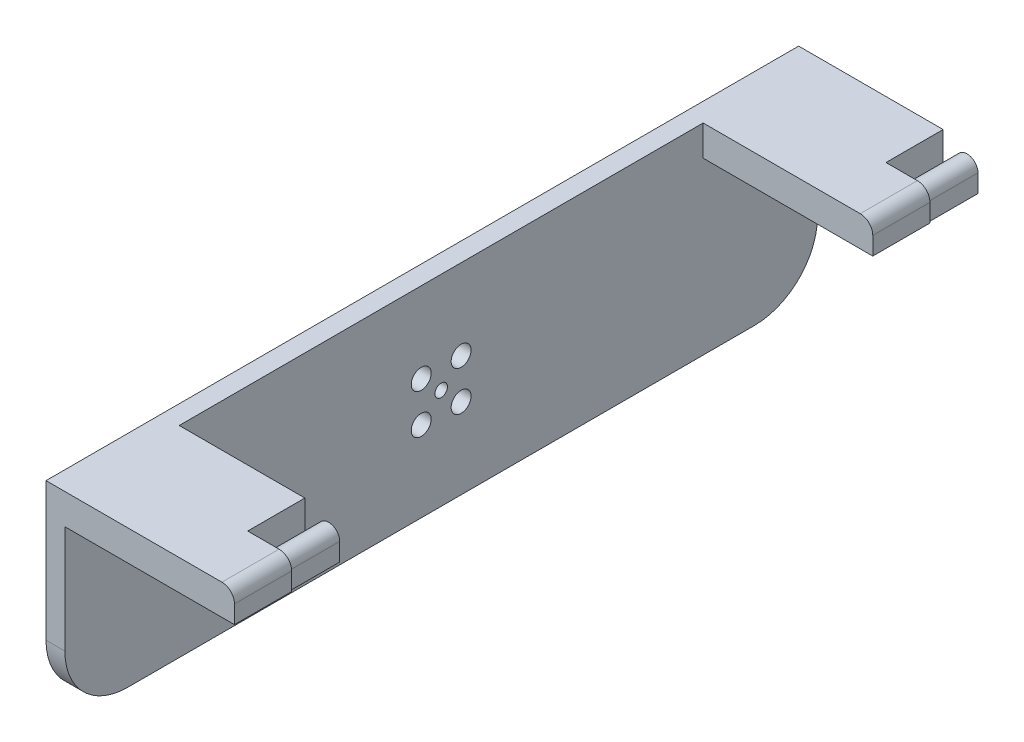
from build123d import *

# Parameters (mm, degrees)
EXTRUDE1_DEPTH           = 7.9
SKETCH2_R                = 0.59563
CUT_EXTRUDE1_DEPTH       = 3.5
EXTRUDE2_DEPTH           = 9.1
SKETCH4_W                = 20
SKETCH4_H                = 4.85
EXTRUDE3_DEPTH           = 9.1
SKETCH5_W                = 119.8
SKETCH5_H                = 32
SKETCH5_R                = 1
WIDE_BASE_DEPTH          = 3
LPATTERN1_COUNT          = 2
LPATTERN1_PITCH          = 101.6
EXTRUDE5_START           = 7.9
EXTRUDE5_DEPTH           = 7.9
SKETCH7_R                = 0.59563
CUT_EXTRUDE2_DEPTH       = 3
FILLET1_R                = 10
SKETCH10_R               = 1.5875
F_2SMALL_TOP_HOLES_DEPTH = 111.439304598


with BuildPart() as part:
    # Sketch1 → Extrude1 (new body)
    with BuildSketch(Plane.XY):
        with BuildLine():
            Line((-1.75, 0), (-1.75, -2.85))
            Line((-1.75, -2.85), (1.75, -2.85))
            Line((1.75, -2.85), (1.75, 0))
            ThreePointArc((1.75, 0), (0, 1.75), (-1.75, 0))
        make_face()
    extrude(amount=EXTRUDE1_DEPTH)

    # Sketch2 → Cut-Extrude1 (cut)
    with BuildSketch(Plane.XZ.offset(2.85)):
        with Locations(Location((0, 6.4, 0), (0, 0, 270))):
            Circle(SKETCH2_R)
    extrude(amount=-CUT_EXTRUDE1_DEPTH, mode=Mode.SUBTRACT)

    # Sketch3 → Extrude2 (add)
    with BuildSketch(Plane.XY.offset(7.9)):
        with BuildLine():
            Line((2, -2.85), (-25, -2.85))
            Line((-25, -2.85), (-25, 2))
            Line((-25, 2), (0, 2))
            ThreePointArc((0, 2), (1.414213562, 1.414213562), (2, 0))
            Line((2, 0), (2, -2.85))
        make_face()
    extrude2 = extrude(amount=EXTRUDE2_DEPTH)

    # Sketch4 → Extrude3 (add)
    with BuildSketch(Plane(origin=(0, 0, 7.9), x_dir=(-1, 0, 0), z_dir=(0, 0, -1))):
        with Locations((15, -0.425)):
            Rectangle(SKETCH4_W, SKETCH4_H)
    extrude3 = extrude(amount=EXTRUDE3_DEPTH)

    # Sketch5 → WIDE_BASE (add)
    with BuildSketch(Plane.ZY.offset(25)):
        with Locations((-42.9, -14)):
            Rectangle(SKETCH5_W, SKETCH5_H)
        with Locations((-42.9, -14)):
            Circle(SKETCH5_R, mode=Mode.SUBTRACT)
    extrude(amount=WIDE_BASE_DEPTH)

    # LPattern1: Extrude2, Extrude3 ×2
    with Locations(*[(0, 0, -i * LPATTERN1_PITCH) for i in range(1, LPATTERN1_COUNT)]):
        add(extrude2)
        add(extrude3)

    # Sketch6 → Extrude5 (add)
    with BuildSketch(Plane(origin=(0, 0, -93.7), x_dir=(-1, 0, 0), z_dir=(0, 0, -1)).offset(EXTRUDE5_START)):
        with BuildLine():
            Line((-1.75, -2.85), (1.75, -2.85))
            Line((1.75, -2.85), (1.75, 0))
            ThreePointArc((1.75, 0), (0, 1.75), (-1.75, 0))
            Line((-1.75, 0), (-1.75, -2.85))
        make_face()
    extrude(amount=-EXTRUDE5_DEPTH)

    # Sketch7 → Cut-Extrude2 (cut)
    with BuildSketch(Plane.XZ.offset(2.85)):
        with Locations(Location((0, -95.2, 0), (0, 0, 270))):
            Circle(SKETCH7_R)
    extrude(amount=-CUT_EXTRUDE2_DEPTH, mode=Mode.SUBTRACT)

    # Fillet1
    fillet1_edges = [part.edges().sort_by_distance(p)[0] for p in [
        (-26.5, -30, -102.8),
        (-26.5, -30, 17),
    ]]
    fillet(fillet1_edges, radius=FILLET1_R)

    # Sketch10 → 2small-top-holes (cut, through all)
    with BuildSketch(Plane(origin=(-25, 0, 0), x_dir=(0, 0, -1), z_dir=(1, 0, 0))):
        with Locations((46.075, -10.825)):
            Circle(SKETCH10_R)
        with Locations(Location((39.725, -10.825, 0), (0, 0, 180))):
            Circle(SKETCH10_R)
        with Locations((39.725, -17.175)):
            Circle(SKETCH10_R)
        with Locations(Location((46.075, -17.175, 0), (0, 0, 180))):
            Circle(SKETCH10_R)
    extrude(amount=-F_2SMALL_TOP_HOLES_DEPTH, mode=Mode.SUBTRACT)


solid = part.part
